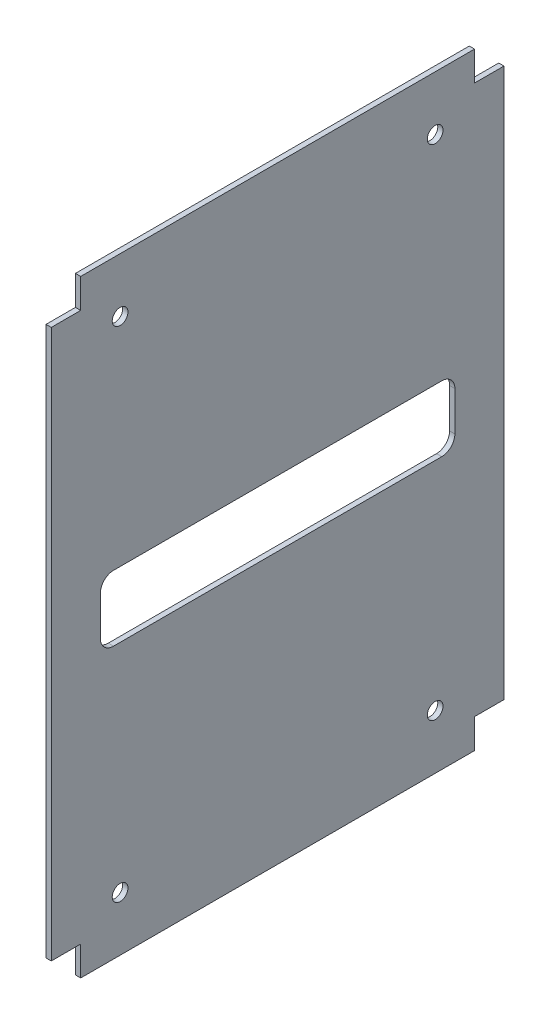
ISO-10303-21;
HEADER;
FILE_DESCRIPTION(('STEP AP214'),'2;1');
FILE_NAME('part.step','',(''),(''),'','','');
FILE_SCHEMA(('AUTOMOTIVE_DESIGN { 1 0 10303 214 1 1 1 1 }'));
ENDSEC;
DATA;
#1=APPLICATION_CONTEXT('core data for automotive mechanical design processes');
#2=APPLICATION_PROTOCOL_DEFINITION('international standard','automotive_design',2000,#1);
#3=PRODUCT_CONTEXT('',#1,'mechanical');
#4=PRODUCT('Part','Part','',(#3));
#5=PRODUCT_RELATED_PRODUCT_CATEGORY('part','',(#4));
#6=PRODUCT_DEFINITION_FORMATION('','',#4);
#7=PRODUCT_DEFINITION_CONTEXT('part definition',#1,'design');
#8=PRODUCT_DEFINITION('design','',#6,#7);
#9=PRODUCT_DEFINITION_SHAPE('','',#8);
#10=(LENGTH_UNIT() NAMED_UNIT(*) SI_UNIT(.MILLI.,.METRE.));
#11=(NAMED_UNIT(*) PLANE_ANGLE_UNIT() SI_UNIT($,.RADIAN.));
#12=(NAMED_UNIT(*) SI_UNIT($,.STERADIAN.) SOLID_ANGLE_UNIT());
#13=UNCERTAINTY_MEASURE_WITH_UNIT(LENGTH_MEASURE(1.E-05),#10,'distance_accuracy_value','');
#14=(GEOMETRIC_REPRESENTATION_CONTEXT(3) GLOBAL_UNCERTAINTY_ASSIGNED_CONTEXT((#13)) GLOBAL_UNIT_ASSIGNED_CONTEXT((#10,
#11,#12)) REPRESENTATION_CONTEXT('',''));
#15=CARTESIAN_POINT('',(0.,0.,0.));
#16=DIRECTION('',(0.,0.,1.));
#17=DIRECTION('',(1.,0.,0.));
#18=AXIS2_PLACEMENT_3D('',#15,#16,#17);
#19=CARTESIAN_POINT('',(-1.99999999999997,108.5,75.));
#20=DIRECTION('',(1.,0.,0.));
#21=DIRECTION('',(0.,0.,-1.));
#22=AXIS2_PLACEMENT_3D('',#19,#20,#21);
#23=PLANE('',#22);
#24=DIRECTION('',(0.,0.,-1.));
#25=VECTOR('',#24,1.);
#26=CARTESIAN_POINT('',(-1.99999999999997,-12.5,75.));
#27=LINE('',#26,#25);
#28=CARTESIAN_POINT('',(-1.99999999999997,-12.5,62.5));
#29=VERTEX_POINT('',#28);
#30=CARTESIAN_POINT('',(-1.99999999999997,-12.5,-62.5));
#31=VERTEX_POINT('',#30);
#32=EDGE_CURVE('E460',#29,#31,#27,.T.);
#33=ORIENTED_EDGE('',*,*,#32,.T.);
#34=CARTESIAN_POINT('',(-1.99999999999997,-7.5,-62.5));
#35=DIRECTION('',(1.,0.,0.));
#36=DIRECTION('',(0.,0.,-1.));
#37=AXIS2_PLACEMENT_3D('',#34,#35,#36);
#38=CIRCLE('',#37,5.00000000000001);
#39=CARTESIAN_POINT('',(-1.99999999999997,-7.5,-67.5));
#40=VERTEX_POINT('',#39);
#41=EDGE_CURVE('E463',#31,#40,#38,.T.);
#42=ORIENTED_EDGE('',*,*,#41,.T.);
#43=DIRECTION('',(0.,1.,0.));
#44=VECTOR('',#43,1.);
#45=CARTESIAN_POINT('',(-1.99999999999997,108.5,-67.5));
#46=LINE('',#45,#44);
#47=CARTESIAN_POINT('',(-1.99999999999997,7.49999999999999,-67.5));
#48=VERTEX_POINT('',#47);
#49=EDGE_CURVE('E428',#40,#48,#46,.T.);
#50=ORIENTED_EDGE('',*,*,#49,.T.);
#51=CARTESIAN_POINT('',(-1.99999999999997,7.5,-62.5));
#52=DIRECTION('',(1.,0.,0.));
#53=DIRECTION('',(0.,0.,-1.));
#54=AXIS2_PLACEMENT_3D('',#51,#52,#53);
#55=CIRCLE('',#54,5.00000000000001);
#56=CARTESIAN_POINT('',(-1.99999999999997,12.5,-62.5));
#57=VERTEX_POINT('',#56);
#58=EDGE_CURVE('E445',#48,#57,#55,.T.);
#59=ORIENTED_EDGE('',*,*,#58,.T.);
#60=DIRECTION('',(0.,0.,1.));
#61=VECTOR('',#60,1.);
#62=CARTESIAN_POINT('',(-1.99999999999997,12.5,75.));
#63=LINE('',#62,#61);
#64=CARTESIAN_POINT('',(-1.99999999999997,12.5,62.5));
#65=VERTEX_POINT('',#64);
#66=EDGE_CURVE('E448',#57,#65,#63,.T.);
#67=ORIENTED_EDGE('',*,*,#66,.T.);
#68=CARTESIAN_POINT('',(-1.99999999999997,7.5,62.5));
#69=DIRECTION('',(1.,0.,0.));
#70=DIRECTION('',(0.,0.,-1.));
#71=AXIS2_PLACEMENT_3D('',#68,#69,#70);
#72=CIRCLE('',#71,5.);
#73=CARTESIAN_POINT('',(-1.99999999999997,7.5,67.5));
#74=VERTEX_POINT('',#73);
#75=EDGE_CURVE('E451',#65,#74,#72,.T.);
#76=ORIENTED_EDGE('',*,*,#75,.T.);
#77=DIRECTION('',(0.,-1.,0.));
#78=VECTOR('',#77,1.);
#79=CARTESIAN_POINT('',(-1.99999999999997,108.5,67.5));
#80=LINE('',#79,#78);
#81=CARTESIAN_POINT('',(-1.99999999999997,-7.5,67.5));
#82=VERTEX_POINT('',#81);
#83=EDGE_CURVE('E454',#74,#82,#80,.T.);
#84=ORIENTED_EDGE('',*,*,#83,.T.);
#85=CARTESIAN_POINT('',(-1.99999999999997,-7.5,62.5));
#86=DIRECTION('',(1.,0.,0.));
#87=DIRECTION('',(0.,0.,-1.));
#88=AXIS2_PLACEMENT_3D('',#85,#86,#87);
#89=CIRCLE('',#88,5.);
#90=EDGE_CURVE('E457',#82,#29,#89,.T.);
#91=ORIENTED_EDGE('',*,*,#90,.T.);
#92=EDGE_LOOP('',(#33,#42,#50,#59,#67,#76,#84,#91));
#93=FACE_BOUND('',#92,.T.);
#94=CARTESIAN_POINT('',(-1.99999999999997,95.0000000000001,60.0000000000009));
#95=DIRECTION('',(1.,0.,0.));
#96=DIRECTION('',(0.,0.,-1.));
#97=AXIS2_PLACEMENT_3D('',#94,#95,#96);
#98=CIRCLE('',#97,3.);
#99=CARTESIAN_POINT('',(-1.99999999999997,95.0000000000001,57.0000000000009));
#100=VERTEX_POINT('',#99);
#101=EDGE_CURVE('E469',#100,#100,#98,.T.);
#102=ORIENTED_EDGE('',*,*,#101,.T.);
#103=EDGE_LOOP('',(#102));
#104=FACE_BOUND('',#103,.T.);
#105=CARTESIAN_POINT('',(-1.99999999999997,95.0000000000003,-59.9999999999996));
#106=DIRECTION('',(1.,0.,0.));
#107=DIRECTION('',(0.,0.,-1.));
#108=AXIS2_PLACEMENT_3D('',#105,#106,#107);
#109=CIRCLE('',#108,3.);
#110=CARTESIAN_POINT('',(-1.99999999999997,95.0000000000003,-62.9999999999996));
#111=VERTEX_POINT('',#110);
#112=EDGE_CURVE('E475',#111,#111,#109,.T.);
#113=ORIENTED_EDGE('',*,*,#112,.T.);
#114=EDGE_LOOP('',(#113));
#115=FACE_BOUND('',#114,.T.);
#116=CARTESIAN_POINT('',(-1.99999999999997,-94.9999999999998,-60.));
#117=DIRECTION('',(1.,0.,0.));
#118=DIRECTION('',(0.,0.,-1.));
#119=AXIS2_PLACEMENT_3D('',#116,#117,#118);
#120=CIRCLE('',#119,3.);
#121=CARTESIAN_POINT('',(-1.99999999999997,-94.9999999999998,-63.));
#122=VERTEX_POINT('',#121);
#123=EDGE_CURVE('E481',#122,#122,#120,.T.);
#124=ORIENTED_EDGE('',*,*,#123,.T.);
#125=EDGE_LOOP('',(#124));
#126=FACE_BOUND('',#125,.T.);
#127=CARTESIAN_POINT('',(-1.99999999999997,-94.9999999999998,60.0000000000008));
#128=DIRECTION('',(1.,0.,0.));
#129=DIRECTION('',(0.,0.,-1.));
#130=AXIS2_PLACEMENT_3D('',#127,#128,#129);
#131=CIRCLE('',#130,3.);
#132=CARTESIAN_POINT('',(-1.99999999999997,-94.9999999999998,57.0000000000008));
#133=VERTEX_POINT('',#132);
#134=EDGE_CURVE('E487',#133,#133,#131,.T.);
#135=ORIENTED_EDGE('',*,*,#134,.T.);
#136=EDGE_LOOP('',(#135));
#137=FACE_BOUND('',#136,.T.);
#138=DIRECTION('',(0.,1.,0.));
#139=VECTOR('',#138,1.);
#140=CARTESIAN_POINT('',(-1.99999999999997,106.856194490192,-75.));
#141=LINE('',#140,#139);
#142=CARTESIAN_POINT('',(-1.99999999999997,104.5,-75.));
#143=VERTEX_POINT('',#142);
#144=CARTESIAN_POINT('',(-1.99999999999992,115.712388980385,-75.));
#145=VERTEX_POINT('',#144);
#146=EDGE_CURVE('E332',#143,#145,#141,.T.);
#147=ORIENTED_EDGE('',*,*,#146,.F.);
#148=DIRECTION('',(0.,0.,-1.));
#149=VECTOR('',#148,1.);
#150=CARTESIAN_POINT('',(-1.99999999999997,104.5,-77.3561944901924));
#151=LINE('',#150,#149);
#152=CARTESIAN_POINT('',(-1.9999999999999,104.5,-86.2123889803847));
#153=VERTEX_POINT('',#152);
#154=EDGE_CURVE('E199',#153,#143,#151,.F.);
#155=ORIENTED_EDGE('',*,*,#154,.F.);
#156=DIRECTION('',(0.,1.,0.));
#157=VECTOR('',#156,1.);
#158=CARTESIAN_POINT('',(-1.9999999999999,0.,-86.2123889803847));
#159=LINE('',#158,#157);
#160=CARTESIAN_POINT('',(-1.9999999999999,-104.5,-86.2123889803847));
#161=VERTEX_POINT('',#160);
#162=EDGE_CURVE('E388',#153,#161,#159,.F.);
#163=ORIENTED_EDGE('',*,*,#162,.T.);
#164=DIRECTION('',(0.,0.,-1.));
#165=VECTOR('',#164,1.);
#166=CARTESIAN_POINT('',(-1.99999999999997,-104.5,-77.3561944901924));
#167=LINE('',#166,#165);
#168=CARTESIAN_POINT('',(-1.99999999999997,-104.5,-75.));
#169=VERTEX_POINT('',#168);
#170=EDGE_CURVE('E387',#169,#161,#167,.T.);
#171=ORIENTED_EDGE('',*,*,#170,.F.);
#172=DIRECTION('',(0.,1.,0.));
#173=VECTOR('',#172,1.);
#174=CARTESIAN_POINT('',(-1.99999999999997,-106.856194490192,-75.));
#175=LINE('',#174,#173);
#176=CARTESIAN_POINT('',(-1.99999999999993,-115.712388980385,-75.));
#177=VERTEX_POINT('',#176);
#178=EDGE_CURVE('E360',#177,#169,#175,.T.);
#179=ORIENTED_EDGE('',*,*,#178,.F.);
#180=DIRECTION('',(0.,0.,-1.));
#181=VECTOR('',#180,1.);
#182=CARTESIAN_POINT('',(-1.99999999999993,-115.712388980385,0.));
#183=LINE('',#182,#181);
#184=CARTESIAN_POINT('',(-1.99999999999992,-115.712388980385,75.));
#185=VERTEX_POINT('',#184);
#186=EDGE_CURVE('E349',#177,#185,#183,.F.);
#187=ORIENTED_EDGE('',*,*,#186,.T.);
#188=DIRECTION('',(0.,1.,0.));
#189=VECTOR('',#188,1.);
#190=CARTESIAN_POINT('',(-1.99999999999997,-106.856194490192,75.));
#191=LINE('',#190,#189);
#192=CARTESIAN_POINT('',(-1.99999999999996,-104.5,75.));
#193=VERTEX_POINT('',#192);
#194=EDGE_CURVE('E348',#193,#185,#191,.F.);
#195=ORIENTED_EDGE('',*,*,#194,.F.);
#196=DIRECTION('',(0.,0.,-1.));
#197=VECTOR('',#196,1.);
#198=CARTESIAN_POINT('',(-1.99999999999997,-104.5,77.3561944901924));
#199=LINE('',#198,#197);
#200=CARTESIAN_POINT('',(-1.9999999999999,-104.5,86.2123889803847));
#201=VERTEX_POINT('',#200);
#202=EDGE_CURVE('E380',#201,#193,#199,.T.);
#203=ORIENTED_EDGE('',*,*,#202,.F.);
#204=DIRECTION('',(0.,-1.,0.));
#205=VECTOR('',#204,1.);
#206=CARTESIAN_POINT('',(-1.9999999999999,0.,86.2123889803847));
#207=LINE('',#206,#205);
#208=CARTESIAN_POINT('',(-1.9999999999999,104.5,86.2123889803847));
#209=VERTEX_POINT('',#208);
#210=EDGE_CURVE('E370',#201,#209,#207,.F.);
#211=ORIENTED_EDGE('',*,*,#210,.T.);
#212=DIRECTION('',(0.,0.,-1.));
#213=VECTOR('',#212,1.);
#214=CARTESIAN_POINT('',(-1.99999999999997,104.5,77.3561944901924));
#215=LINE('',#214,#213);
#216=CARTESIAN_POINT('',(-1.99999999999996,104.5,75.));
#217=VERTEX_POINT('',#216);
#218=EDGE_CURVE('E191',#217,#209,#215,.F.);
#219=ORIENTED_EDGE('',*,*,#218,.F.);
#220=DIRECTION('',(0.,1.,0.));
#221=VECTOR('',#220,1.);
#222=CARTESIAN_POINT('',(-1.99999999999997,106.856194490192,75.));
#223=LINE('',#222,#221);
#224=CARTESIAN_POINT('',(-1.99999999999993,115.712388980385,75.));
#225=VERTEX_POINT('',#224);
#226=EDGE_CURVE('E341',#225,#217,#223,.F.);
#227=ORIENTED_EDGE('',*,*,#226,.F.);
#228=DIRECTION('',(0.,0.,1.));
#229=VECTOR('',#228,1.);
#230=CARTESIAN_POINT('',(-1.99999999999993,115.712388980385,0.));
#231=LINE('',#230,#229);
#232=EDGE_CURVE('E331',#225,#145,#231,.F.);
#233=ORIENTED_EDGE('',*,*,#232,.T.);
#234=EDGE_LOOP('',(#147,#155,#163,#171,#179,#187,#195,#203,#211,#219,#227,#233));
#235=FACE_BOUND('',#234,.T.);
#236=ADVANCED_FACE('F176',(#93,#104,#115,#126,#137,#235),#23,.F.);
#237=CARTESIAN_POINT('',(0.,108.5,75.));
#238=DIRECTION('',(1.,0.,0.));
#239=DIRECTION('',(0.,0.,-1.));
#240=AXIS2_PLACEMENT_3D('',#237,#238,#239);
#241=PLANE('',#240);
#242=CARTESIAN_POINT('',(0.,-7.5,-62.5));
#243=DIRECTION('',(1.,0.,0.));
#244=DIRECTION('',(0.,0.,1.));
#245=AXIS2_PLACEMENT_3D('',#242,#243,#244);
#246=CIRCLE('',#245,5.00000000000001);
#247=CARTESIAN_POINT('',(0.,-12.5,-62.5));
#248=VERTEX_POINT('',#247);
#249=CARTESIAN_POINT('',(0.,-7.49999999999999,-67.5));
#250=VERTEX_POINT('',#249);
#251=EDGE_CURVE('E400',#248,#250,#246,.T.);
#252=ORIENTED_EDGE('',*,*,#251,.F.);
#253=DIRECTION('',(0.,0.,-1.));
#254=VECTOR('',#253,1.);
#255=CARTESIAN_POINT('',(0.,-12.5,62.5));
#256=LINE('',#255,#254);
#257=CARTESIAN_POINT('',(0.,-12.5,62.5));
#258=VERTEX_POINT('',#257);
#259=EDGE_CURVE('E422',#258,#248,#256,.T.);
#260=ORIENTED_EDGE('',*,*,#259,.F.);
#261=CARTESIAN_POINT('',(0.,-7.5,62.5));
#262=DIRECTION('',(1.,0.,0.));
#263=DIRECTION('',(0.,0.,1.));
#264=AXIS2_PLACEMENT_3D('',#261,#262,#263);
#265=CIRCLE('',#264,5.);
#266=CARTESIAN_POINT('',(0.,-7.5,67.5));
#267=VERTEX_POINT('',#266);
#268=EDGE_CURVE('E419',#267,#258,#265,.T.);
#269=ORIENTED_EDGE('',*,*,#268,.F.);
#270=DIRECTION('',(0.,-1.,0.));
#271=VECTOR('',#270,1.);
#272=CARTESIAN_POINT('',(0.,-7.5,67.5));
#273=LINE('',#272,#271);
#274=CARTESIAN_POINT('',(0.,7.5,67.5));
#275=VERTEX_POINT('',#274);
#276=EDGE_CURVE('E416',#275,#267,#273,.T.);
#277=ORIENTED_EDGE('',*,*,#276,.F.);
#278=CARTESIAN_POINT('',(0.,7.5,62.5));
#279=DIRECTION('',(1.,0.,0.));
#280=DIRECTION('',(0.,0.,1.));
#281=AXIS2_PLACEMENT_3D('',#278,#279,#280);
#282=CIRCLE('',#281,5.);
#283=CARTESIAN_POINT('',(0.,12.5,62.5));
#284=VERTEX_POINT('',#283);
#285=EDGE_CURVE('E413',#284,#275,#282,.T.);
#286=ORIENTED_EDGE('',*,*,#285,.F.);
#287=DIRECTION('',(0.,0.,1.));
#288=VECTOR('',#287,1.);
#289=CARTESIAN_POINT('',(0.,12.5,62.5));
#290=LINE('',#289,#288);
#291=CARTESIAN_POINT('',(0.,12.5,-62.5));
#292=VERTEX_POINT('',#291);
#293=EDGE_CURVE('E410',#292,#284,#290,.T.);
#294=ORIENTED_EDGE('',*,*,#293,.F.);
#295=CARTESIAN_POINT('',(0.,7.5,-62.5));
#296=DIRECTION('',(1.,0.,0.));
#297=DIRECTION('',(0.,0.,1.));
#298=AXIS2_PLACEMENT_3D('',#295,#296,#297);
#299=CIRCLE('',#298,5.00000000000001);
#300=CARTESIAN_POINT('',(0.,7.5,-67.5));
#301=VERTEX_POINT('',#300);
#302=EDGE_CURVE('E407',#301,#292,#299,.T.);
#303=ORIENTED_EDGE('',*,*,#302,.F.);
#304=DIRECTION('',(0.,1.,0.));
#305=VECTOR('',#304,1.);
#306=CARTESIAN_POINT('',(0.,-7.5,-67.5));
#307=LINE('',#306,#305);
#308=EDGE_CURVE('E404',#250,#301,#307,.T.);
#309=ORIENTED_EDGE('',*,*,#308,.F.);
#310=EDGE_LOOP('',(#252,#260,#269,#277,#286,#294,#303,#309));
#311=FACE_BOUND('',#310,.T.);
#312=CARTESIAN_POINT('',(0.,95.0000000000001,60.0000000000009));
#313=DIRECTION('',(1.,0.,0.));
#314=DIRECTION('',(0.,0.,-1.));
#315=AXIS2_PLACEMENT_3D('',#312,#313,#314);
#316=CIRCLE('',#315,3.);
#317=CARTESIAN_POINT('',(0.,95.0000000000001,57.0000000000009));
#318=VERTEX_POINT('',#317);
#319=EDGE_CURVE('E466',#318,#318,#316,.T.);
#320=ORIENTED_EDGE('',*,*,#319,.F.);
#321=EDGE_LOOP('',(#320));
#322=FACE_BOUND('',#321,.T.);
#323=CARTESIAN_POINT('',(0.,95.0000000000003,-59.9999999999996));
#324=DIRECTION('',(1.,0.,0.));
#325=DIRECTION('',(0.,0.,-1.));
#326=AXIS2_PLACEMENT_3D('',#323,#324,#325);
#327=CIRCLE('',#326,3.);
#328=CARTESIAN_POINT('',(0.,95.0000000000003,-62.9999999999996));
#329=VERTEX_POINT('',#328);
#330=EDGE_CURVE('E472',#329,#329,#327,.T.);
#331=ORIENTED_EDGE('',*,*,#330,.F.);
#332=EDGE_LOOP('',(#331));
#333=FACE_BOUND('',#332,.T.);
#334=CARTESIAN_POINT('',(0.,-94.9999999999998,-60.));
#335=DIRECTION('',(1.,0.,0.));
#336=DIRECTION('',(0.,0.,-1.));
#337=AXIS2_PLACEMENT_3D('',#334,#335,#336);
#338=CIRCLE('',#337,3.);
#339=CARTESIAN_POINT('',(0.,-94.9999999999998,-63.));
#340=VERTEX_POINT('',#339);
#341=EDGE_CURVE('E478',#340,#340,#338,.T.);
#342=ORIENTED_EDGE('',*,*,#341,.F.);
#343=EDGE_LOOP('',(#342));
#344=FACE_BOUND('',#343,.T.);
#345=CARTESIAN_POINT('',(0.,-94.9999999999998,60.0000000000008));
#346=DIRECTION('',(1.,0.,0.));
#347=DIRECTION('',(0.,0.,-1.));
#348=AXIS2_PLACEMENT_3D('',#345,#346,#347);
#349=CIRCLE('',#348,3.);
#350=CARTESIAN_POINT('',(0.,-94.9999999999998,57.0000000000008));
#351=VERTEX_POINT('',#350);
#352=EDGE_CURVE('E484',#351,#351,#349,.T.);
#353=ORIENTED_EDGE('',*,*,#352,.F.);
#354=EDGE_LOOP('',(#353));
#355=FACE_BOUND('',#354,.T.);
#356=DIRECTION('',(0.,1.,0.));
#357=VECTOR('',#356,1.);
#358=CARTESIAN_POINT('',(0.,106.856194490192,75.));
#359=LINE('',#358,#357);
#360=CARTESIAN_POINT('',(0.,115.712388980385,75.));
#361=VERTEX_POINT('',#360);
#362=CARTESIAN_POINT('',(0.,104.5,75.));
#363=VERTEX_POINT('',#362);
#364=EDGE_CURVE('E314',#361,#363,#359,.F.);
#365=ORIENTED_EDGE('',*,*,#364,.T.);
#366=DIRECTION('',(0.,0.,-1.));
#367=VECTOR('',#366,1.);
#368=CARTESIAN_POINT('',(0.,104.5,77.3561944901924));
#369=LINE('',#368,#367);
#370=CARTESIAN_POINT('',(0.,104.5,86.2123889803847));
#371=VERTEX_POINT('',#370);
#372=EDGE_CURVE('E377',#363,#371,#369,.F.);
#373=ORIENTED_EDGE('',*,*,#372,.T.);
#374=DIRECTION('',(0.,1.,0.));
#375=VECTOR('',#374,1.);
#376=CARTESIAN_POINT('',(0.,104.5,86.2123889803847));
#377=LINE('',#376,#375);
#378=CARTESIAN_POINT('',(0.,-104.5,86.2123889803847));
#379=VERTEX_POINT('',#378);
#380=EDGE_CURVE('E363',#379,#371,#377,.T.);
#381=ORIENTED_EDGE('',*,*,#380,.F.);
#382=DIRECTION('',(0.,0.,-1.));
#383=VECTOR('',#382,1.);
#384=CARTESIAN_POINT('',(0.,-104.5,77.3561944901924));
#385=LINE('',#384,#383);
#386=CARTESIAN_POINT('',(0.,-104.5,75.));
#387=VERTEX_POINT('',#386);
#388=EDGE_CURVE('E379',#379,#387,#385,.T.);
#389=ORIENTED_EDGE('',*,*,#388,.T.);
#390=DIRECTION('',(0.,1.,0.));
#391=VECTOR('',#390,1.);
#392=CARTESIAN_POINT('',(0.,-106.856194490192,75.));
#393=LINE('',#392,#391);
#394=CARTESIAN_POINT('',(0.,-115.712388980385,75.));
#395=VERTEX_POINT('',#394);
#396=EDGE_CURVE('E357',#387,#395,#393,.F.);
#397=ORIENTED_EDGE('',*,*,#396,.T.);
#398=DIRECTION('',(0.,0.,1.));
#399=VECTOR('',#398,1.);
#400=CARTESIAN_POINT('',(0.,-115.712388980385,75.));
#401=LINE('',#400,#399);
#402=CARTESIAN_POINT('',(0.,-115.712388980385,-75.));
#403=VERTEX_POINT('',#402);
#404=EDGE_CURVE('E322',#403,#395,#401,.T.);
#405=ORIENTED_EDGE('',*,*,#404,.F.);
#406=DIRECTION('',(0.,1.,0.));
#407=VECTOR('',#406,1.);
#408=CARTESIAN_POINT('',(0.,-106.856194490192,-75.));
#409=LINE('',#408,#407);
#410=CARTESIAN_POINT('',(0.,-104.5,-75.));
#411=VERTEX_POINT('',#410);
#412=EDGE_CURVE('E359',#403,#411,#409,.T.);
#413=ORIENTED_EDGE('',*,*,#412,.T.);
#414=DIRECTION('',(0.,0.,-1.));
#415=VECTOR('',#414,1.);
#416=CARTESIAN_POINT('',(0.,-104.5,-77.3561944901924));
#417=LINE('',#416,#415);
#418=CARTESIAN_POINT('',(0.,-104.5,-86.2123889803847));
#419=VERTEX_POINT('',#418);
#420=EDGE_CURVE('E396',#411,#419,#417,.T.);
#421=ORIENTED_EDGE('',*,*,#420,.T.);
#422=DIRECTION('',(0.,-1.,0.));
#423=VECTOR('',#422,1.);
#424=CARTESIAN_POINT('',(0.,-104.5,-86.2123889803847));
#425=LINE('',#424,#423);
#426=CARTESIAN_POINT('',(0.,104.5,-86.2123889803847));
#427=VERTEX_POINT('',#426);
#428=EDGE_CURVE('E382',#427,#419,#425,.T.);
#429=ORIENTED_EDGE('',*,*,#428,.F.);
#430=DIRECTION('',(0.,0.,-1.));
#431=VECTOR('',#430,1.);
#432=CARTESIAN_POINT('',(0.,104.5,-77.3561944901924));
#433=LINE('',#432,#431);
#434=CARTESIAN_POINT('',(0.,104.5,-75.));
#435=VERTEX_POINT('',#434);
#436=EDGE_CURVE('E398',#427,#435,#433,.F.);
#437=ORIENTED_EDGE('',*,*,#436,.T.);
#438=DIRECTION('',(0.,1.,0.));
#439=VECTOR('',#438,1.);
#440=CARTESIAN_POINT('',(0.,106.856194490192,-75.));
#441=LINE('',#440,#439);
#442=CARTESIAN_POINT('',(0.,115.712388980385,-75.));
#443=VERTEX_POINT('',#442);
#444=EDGE_CURVE('E323',#435,#443,#441,.T.);
#445=ORIENTED_EDGE('',*,*,#444,.T.);
#446=DIRECTION('',(0.,0.,-1.));
#447=VECTOR('',#446,1.);
#448=CARTESIAN_POINT('',(0.,115.712388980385,-75.));
#449=LINE('',#448,#447);
#450=EDGE_CURVE('E329',#361,#443,#449,.T.);
#451=ORIENTED_EDGE('',*,*,#450,.F.);
#452=EDGE_LOOP('',(#365,#373,#381,#389,#397,#405,#413,#421,#429,#437,#445,#451));
#453=FACE_BOUND('',#452,.T.);
#454=ADVANCED_FACE('F178',(#311,#322,#333,#344,#355,#453),#241,.T.);
#455=CARTESIAN_POINT('',(0.,-94.9999999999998,60.0000000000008));
#456=DIRECTION('',(1.,0.,0.));
#457=DIRECTION('',(0.,0.,-1.));
#458=AXIS2_PLACEMENT_3D('',#455,#456,#457);
#459=CYLINDRICAL_SURFACE('',#458,3.);
#460=ORIENTED_EDGE('',*,*,#352,.T.);
#461=EDGE_LOOP('',(#460));
#462=FACE_BOUND('',#461,.T.);
#463=ORIENTED_EDGE('',*,*,#134,.F.);
#464=EDGE_LOOP('',(#463));
#465=FACE_BOUND('',#464,.T.);
#466=ADVANCED_FACE('F545',(#462,#465),#459,.F.);
#467=CARTESIAN_POINT('',(0.,-94.9999999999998,-60.));
#468=DIRECTION('',(1.,0.,0.));
#469=DIRECTION('',(0.,0.,-1.));
#470=AXIS2_PLACEMENT_3D('',#467,#468,#469);
#471=CYLINDRICAL_SURFACE('',#470,3.);
#472=ORIENTED_EDGE('',*,*,#341,.T.);
#473=EDGE_LOOP('',(#472));
#474=FACE_BOUND('',#473,.T.);
#475=ORIENTED_EDGE('',*,*,#123,.F.);
#476=EDGE_LOOP('',(#475));
#477=FACE_BOUND('',#476,.T.);
#478=ADVANCED_FACE('F551',(#474,#477),#471,.F.);
#479=CARTESIAN_POINT('',(0.,95.0000000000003,-59.9999999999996));
#480=DIRECTION('',(1.,0.,0.));
#481=DIRECTION('',(0.,0.,-1.));
#482=AXIS2_PLACEMENT_3D('',#479,#480,#481);
#483=CYLINDRICAL_SURFACE('',#482,3.);
#484=ORIENTED_EDGE('',*,*,#330,.T.);
#485=EDGE_LOOP('',(#484));
#486=FACE_BOUND('',#485,.T.);
#487=ORIENTED_EDGE('',*,*,#112,.F.);
#488=EDGE_LOOP('',(#487));
#489=FACE_BOUND('',#488,.T.);
#490=ADVANCED_FACE('F555',(#486,#489),#483,.F.);
#491=CARTESIAN_POINT('',(0.,95.0000000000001,60.0000000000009));
#492=DIRECTION('',(1.,0.,0.));
#493=DIRECTION('',(0.,0.,-1.));
#494=AXIS2_PLACEMENT_3D('',#491,#492,#493);
#495=CYLINDRICAL_SURFACE('',#494,3.);
#496=ORIENTED_EDGE('',*,*,#319,.T.);
#497=EDGE_LOOP('',(#496));
#498=FACE_BOUND('',#497,.T.);
#499=ORIENTED_EDGE('',*,*,#101,.F.);
#500=EDGE_LOOP('',(#499));
#501=FACE_BOUND('',#500,.T.);
#502=ADVANCED_FACE('F559',(#498,#501),#495,.F.);
#503=CARTESIAN_POINT('',(-10.,-7.5,-62.5));
#504=DIRECTION('',(1.,0.,0.));
#505=DIRECTION('',(0.,0.,-1.));
#506=AXIS2_PLACEMENT_3D('',#503,#504,#505);
#507=CYLINDRICAL_SURFACE('',#506,5.00000000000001);
#508=DIRECTION('',(1.,0.,0.));
#509=VECTOR('',#508,1.);
#510=CARTESIAN_POINT('',(-10.,-12.5,-62.5));
#511=LINE('',#510,#509);
#512=EDGE_CURVE('E426',#31,#248,#511,.T.);
#513=ORIENTED_EDGE('',*,*,#512,.T.);
#514=ORIENTED_EDGE('',*,*,#251,.T.);
#515=DIRECTION('',(1.,0.,0.));
#516=VECTOR('',#515,1.);
#517=CARTESIAN_POINT('',(-10.,-7.5,-67.5));
#518=LINE('',#517,#516);
#519=EDGE_CURVE('E425',#40,#250,#518,.T.);
#520=ORIENTED_EDGE('',*,*,#519,.F.);
#521=ORIENTED_EDGE('',*,*,#41,.F.);
#522=EDGE_LOOP('',(#513,#514,#520,#521));
#523=FACE_BOUND('',#522,.T.);
#524=ADVANCED_FACE('F563',(#523),#507,.F.);
#525=CARTESIAN_POINT('',(-10.,-12.5,62.5));
#526=DIRECTION('',(0.,-1.,0.));
#527=DIRECTION('',(0.,0.,-1.));
#528=AXIS2_PLACEMENT_3D('',#525,#526,#527);
#529=PLANE('',#528);
#530=DIRECTION('',(1.,0.,0.));
#531=VECTOR('',#530,1.);
#532=CARTESIAN_POINT('',(-10.,-12.5,62.5));
#533=LINE('',#532,#531);
#534=EDGE_CURVE('E429',#29,#258,#533,.T.);
#535=ORIENTED_EDGE('',*,*,#534,.T.);
#536=ORIENTED_EDGE('',*,*,#259,.T.);
#537=ORIENTED_EDGE('',*,*,#512,.F.);
#538=ORIENTED_EDGE('',*,*,#32,.F.);
#539=EDGE_LOOP('',(#535,#536,#537,#538));
#540=FACE_BOUND('',#539,.T.);
#541=ADVANCED_FACE('F567',(#540),#529,.F.);
#542=CARTESIAN_POINT('',(-10.,-7.5,62.5));
#543=DIRECTION('',(1.,0.,0.));
#544=DIRECTION('',(0.,0.,-1.));
#545=AXIS2_PLACEMENT_3D('',#542,#543,#544);
#546=CYLINDRICAL_SURFACE('',#545,5.);
#547=DIRECTION('',(1.,0.,0.));
#548=VECTOR('',#547,1.);
#549=CARTESIAN_POINT('',(-10.,-7.5,67.5));
#550=LINE('',#549,#548);
#551=EDGE_CURVE('E431',#82,#267,#550,.T.);
#552=ORIENTED_EDGE('',*,*,#551,.T.);
#553=ORIENTED_EDGE('',*,*,#268,.T.);
#554=ORIENTED_EDGE('',*,*,#534,.F.);
#555=ORIENTED_EDGE('',*,*,#90,.F.);
#556=EDGE_LOOP('',(#552,#553,#554,#555));
#557=FACE_BOUND('',#556,.T.);
#558=ADVANCED_FACE('F588',(#557),#546,.F.);
#559=CARTESIAN_POINT('',(-10.,-7.5,67.5));
#560=DIRECTION('',(0.,0.,1.));
#561=DIRECTION('',(1.,0.,0.));
#562=AXIS2_PLACEMENT_3D('',#559,#560,#561);
#563=PLANE('',#562);
#564=DIRECTION('',(1.,0.,0.));
#565=VECTOR('',#564,1.);
#566=CARTESIAN_POINT('',(-10.,7.5,67.5));
#567=LINE('',#566,#565);
#568=EDGE_CURVE('E433',#74,#275,#567,.T.);
#569=ORIENTED_EDGE('',*,*,#568,.T.);
#570=ORIENTED_EDGE('',*,*,#276,.T.);
#571=ORIENTED_EDGE('',*,*,#551,.F.);
#572=ORIENTED_EDGE('',*,*,#83,.F.);
#573=EDGE_LOOP('',(#569,#570,#571,#572));
#574=FACE_BOUND('',#573,.T.);
#575=ADVANCED_FACE('F584',(#574),#563,.F.);
#576=CARTESIAN_POINT('',(-10.,7.5,62.5));
#577=DIRECTION('',(1.,0.,0.));
#578=DIRECTION('',(0.,0.,-1.));
#579=AXIS2_PLACEMENT_3D('',#576,#577,#578);
#580=CYLINDRICAL_SURFACE('',#579,5.);
#581=DIRECTION('',(1.,0.,0.));
#582=VECTOR('',#581,1.);
#583=CARTESIAN_POINT('',(-10.,12.5,62.5));
#584=LINE('',#583,#582);
#585=EDGE_CURVE('E435',#65,#284,#584,.T.);
#586=ORIENTED_EDGE('',*,*,#585,.T.);
#587=ORIENTED_EDGE('',*,*,#285,.T.);
#588=ORIENTED_EDGE('',*,*,#568,.F.);
#589=ORIENTED_EDGE('',*,*,#75,.F.);
#590=EDGE_LOOP('',(#586,#587,#588,#589));
#591=FACE_BOUND('',#590,.T.);
#592=ADVANCED_FACE('F580',(#591),#580,.F.);
#593=CARTESIAN_POINT('',(-10.,12.5,62.5));
#594=DIRECTION('',(0.,1.,0.));
#595=DIRECTION('',(0.,0.,1.));
#596=AXIS2_PLACEMENT_3D('',#593,#594,#595);
#597=PLANE('',#596);
#598=DIRECTION('',(1.,0.,0.));
#599=VECTOR('',#598,1.);
#600=CARTESIAN_POINT('',(-10.,12.5,-62.5));
#601=LINE('',#600,#599);
#602=EDGE_CURVE('E437',#57,#292,#601,.T.);
#603=ORIENTED_EDGE('',*,*,#602,.T.);
#604=ORIENTED_EDGE('',*,*,#293,.T.);
#605=ORIENTED_EDGE('',*,*,#585,.F.);
#606=ORIENTED_EDGE('',*,*,#66,.F.);
#607=EDGE_LOOP('',(#603,#604,#605,#606));
#608=FACE_BOUND('',#607,.T.);
#609=ADVANCED_FACE('F576',(#608),#597,.F.);
#610=CARTESIAN_POINT('',(-10.,7.5,-62.5));
#611=DIRECTION('',(1.,0.,0.));
#612=DIRECTION('',(0.,0.,-1.));
#613=AXIS2_PLACEMENT_3D('',#610,#611,#612);
#614=CYLINDRICAL_SURFACE('',#613,5.00000000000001);
#615=DIRECTION('',(1.,0.,0.));
#616=VECTOR('',#615,1.);
#617=CARTESIAN_POINT('',(-10.,7.5,-67.5));
#618=LINE('',#617,#616);
#619=EDGE_CURVE('E439',#48,#301,#618,.T.);
#620=ORIENTED_EDGE('',*,*,#619,.T.);
#621=ORIENTED_EDGE('',*,*,#302,.T.);
#622=ORIENTED_EDGE('',*,*,#602,.F.);
#623=ORIENTED_EDGE('',*,*,#58,.F.);
#624=EDGE_LOOP('',(#620,#621,#622,#623));
#625=FACE_BOUND('',#624,.T.);
#626=ADVANCED_FACE('F572',(#625),#614,.F.);
#627=CARTESIAN_POINT('',(-10.,-7.5,-67.5));
#628=DIRECTION('',(0.,0.,-1.));
#629=DIRECTION('',(-1.,0.,0.));
#630=AXIS2_PLACEMENT_3D('',#627,#628,#629);
#631=PLANE('',#630);
#632=ORIENTED_EDGE('',*,*,#519,.T.);
#633=ORIENTED_EDGE('',*,*,#308,.T.);
#634=ORIENTED_EDGE('',*,*,#619,.F.);
#635=ORIENTED_EDGE('',*,*,#49,.F.);
#636=EDGE_LOOP('',(#632,#633,#634,#635));
#637=FACE_BOUND('',#636,.T.);
#638=ADVANCED_FACE('F569',(#637),#631,.F.);
#639=CARTESIAN_POINT('',(-0.999999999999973,-104.5,-77.3561944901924));
#640=DIRECTION('',(0.,-1.,0.));
#641=DIRECTION('',(0.,0.,-1.));
#642=AXIS2_PLACEMENT_3D('',#639,#640,#641);
#643=PLANE('',#642);
#644=DIRECTION('',(1.,0.,0.));
#645=VECTOR('',#644,1.);
#646=CARTESIAN_POINT('',(-1.99999999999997,-104.5,-75.));
#647=LINE('',#646,#645);
#648=EDGE_CURVE('E493',#169,#411,#647,.T.);
#649=ORIENTED_EDGE('',*,*,#648,.F.);
#650=ORIENTED_EDGE('',*,*,#170,.T.);
#651=DIRECTION('',(-1.,0.,0.));
#652=VECTOR('',#651,1.);
#653=CARTESIAN_POINT('',(0.,-104.5,-86.2123889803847));
#654=LINE('',#653,#652);
#655=EDGE_CURVE('E391',#419,#161,#654,.T.);
#656=ORIENTED_EDGE('',*,*,#655,.F.);
#657=ORIENTED_EDGE('',*,*,#420,.F.);
#658=EDGE_LOOP('',(#649,#650,#656,#657));
#659=FACE_BOUND('',#658,.T.);
#660=ADVANCED_FACE('F507',(#659),#643,.T.);
#661=CARTESIAN_POINT('',(-0.999999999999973,104.5,-77.3561944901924));
#662=DIRECTION('',(0.,-1.,0.));
#663=DIRECTION('',(0.,0.,-1.));
#664=AXIS2_PLACEMENT_3D('',#661,#662,#663);
#665=PLANE('',#664);
#666=ORIENTED_EDGE('',*,*,#154,.T.);
#667=DIRECTION('',(1.,0.,0.));
#668=VECTOR('',#667,1.);
#669=CARTESIAN_POINT('',(-1.99999999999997,104.5,-75.));
#670=LINE('',#669,#668);
#671=EDGE_CURVE('E184',#143,#435,#670,.T.);
#672=ORIENTED_EDGE('',*,*,#671,.T.);
#673=ORIENTED_EDGE('',*,*,#436,.F.);
#674=DIRECTION('',(-1.,0.,0.));
#675=VECTOR('',#674,1.);
#676=CARTESIAN_POINT('',(0.,104.5,-86.2123889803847));
#677=LINE('',#676,#675);
#678=EDGE_CURVE('E385',#427,#153,#677,.T.);
#679=ORIENTED_EDGE('',*,*,#678,.T.);
#680=EDGE_LOOP('',(#666,#672,#673,#679));
#681=FACE_BOUND('',#680,.T.);
#682=ADVANCED_FACE('F495',(#681),#665,.F.);
#683=CARTESIAN_POINT('',(0.,-104.5,-86.2123889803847));
#684=DIRECTION('',(0.,0.,-1.));
#685=DIRECTION('',(-1.,0.,0.));
#686=AXIS2_PLACEMENT_3D('',#683,#684,#685);
#687=PLANE('',#686);
#688=ORIENTED_EDGE('',*,*,#162,.F.);
#689=ORIENTED_EDGE('',*,*,#678,.F.);
#690=ORIENTED_EDGE('',*,*,#428,.T.);
#691=ORIENTED_EDGE('',*,*,#655,.T.);
#692=EDGE_LOOP('',(#688,#689,#690,#691));
#693=FACE_BOUND('',#692,.T.);
#694=ADVANCED_FACE('F503',(#693),#687,.T.);
#695=CARTESIAN_POINT('',(-0.999999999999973,104.5,77.3561944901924));
#696=DIRECTION('',(0.,-1.,0.));
#697=DIRECTION('',(0.,0.,-1.));
#698=AXIS2_PLACEMENT_3D('',#695,#696,#697);
#699=PLANE('',#698);
#700=DIRECTION('',(1.,0.,0.));
#701=VECTOR('',#700,1.);
#702=CARTESIAN_POINT('',(-1.99999999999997,104.5,75.));
#703=LINE('',#702,#701);
#704=EDGE_CURVE('E13',#217,#363,#703,.T.);
#705=ORIENTED_EDGE('',*,*,#704,.F.);
#706=ORIENTED_EDGE('',*,*,#218,.T.);
#707=DIRECTION('',(-1.,0.,0.));
#708=VECTOR('',#707,1.);
#709=CARTESIAN_POINT('',(0.,104.5,86.2123889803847));
#710=LINE('',#709,#708);
#711=EDGE_CURVE('E372',#371,#209,#710,.T.);
#712=ORIENTED_EDGE('',*,*,#711,.F.);
#713=ORIENTED_EDGE('',*,*,#372,.F.);
#714=EDGE_LOOP('',(#705,#706,#712,#713));
#715=FACE_BOUND('',#714,.T.);
#716=ADVANCED_FACE('F530',(#715),#699,.F.);
#717=CARTESIAN_POINT('',(-0.999999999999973,-104.5,77.3561944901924));
#718=DIRECTION('',(0.,-1.,0.));
#719=DIRECTION('',(0.,0.,-1.));
#720=AXIS2_PLACEMENT_3D('',#717,#718,#719);
#721=PLANE('',#720);
#722=ORIENTED_EDGE('',*,*,#202,.T.);
#723=DIRECTION('',(1.,0.,0.));
#724=VECTOR('',#723,1.);
#725=CARTESIAN_POINT('',(-1.99999999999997,-104.5,75.));
#726=LINE('',#725,#724);
#727=EDGE_CURVE('E490',#193,#387,#726,.T.);
#728=ORIENTED_EDGE('',*,*,#727,.T.);
#729=ORIENTED_EDGE('',*,*,#388,.F.);
#730=DIRECTION('',(-1.,0.,0.));
#731=VECTOR('',#730,1.);
#732=CARTESIAN_POINT('',(0.,-104.5,86.2123889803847));
#733=LINE('',#732,#731);
#734=EDGE_CURVE('E367',#379,#201,#733,.T.);
#735=ORIENTED_EDGE('',*,*,#734,.T.);
#736=EDGE_LOOP('',(#722,#728,#729,#735));
#737=FACE_BOUND('',#736,.T.);
#738=ADVANCED_FACE('F524',(#737),#721,.T.);
#739=CARTESIAN_POINT('',(0.,104.5,86.2123889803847));
#740=DIRECTION('',(0.,0.,1.));
#741=DIRECTION('',(1.,0.,0.));
#742=AXIS2_PLACEMENT_3D('',#739,#740,#741);
#743=PLANE('',#742);
#744=ORIENTED_EDGE('',*,*,#210,.F.);
#745=ORIENTED_EDGE('',*,*,#734,.F.);
#746=ORIENTED_EDGE('',*,*,#380,.T.);
#747=ORIENTED_EDGE('',*,*,#711,.T.);
#748=EDGE_LOOP('',(#744,#745,#746,#747));
#749=FACE_BOUND('',#748,.T.);
#750=ADVANCED_FACE('F527',(#749),#743,.T.);
#751=CARTESIAN_POINT('',(-0.999999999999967,-106.856194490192,75.));
#752=DIRECTION('',(0.,0.,-1.));
#753=DIRECTION('',(0.,1.,0.));
#754=AXIS2_PLACEMENT_3D('',#751,#752,#753);
#755=PLANE('',#754);
#756=ORIENTED_EDGE('',*,*,#727,.F.);
#757=ORIENTED_EDGE('',*,*,#194,.T.);
#758=DIRECTION('',(-1.,0.,0.));
#759=VECTOR('',#758,1.);
#760=CARTESIAN_POINT('',(0.,-115.712388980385,75.));
#761=LINE('',#760,#759);
#762=EDGE_CURVE('E352',#395,#185,#761,.T.);
#763=ORIENTED_EDGE('',*,*,#762,.F.);
#764=ORIENTED_EDGE('',*,*,#396,.F.);
#765=EDGE_LOOP('',(#756,#757,#763,#764));
#766=FACE_BOUND('',#765,.T.);
#767=ADVANCED_FACE('F520',(#766),#755,.F.);
#768=CARTESIAN_POINT('',(-0.999999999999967,-106.856194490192,-75.));
#769=DIRECTION('',(0.,0.,-1.));
#770=DIRECTION('',(0.,1.,0.));
#771=AXIS2_PLACEMENT_3D('',#768,#769,#770);
#772=PLANE('',#771);
#773=ORIENTED_EDGE('',*,*,#178,.T.);
#774=ORIENTED_EDGE('',*,*,#648,.T.);
#775=ORIENTED_EDGE('',*,*,#412,.F.);
#776=DIRECTION('',(-1.,0.,0.));
#777=VECTOR('',#776,1.);
#778=CARTESIAN_POINT('',(0.,-115.712388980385,-75.));
#779=LINE('',#778,#777);
#780=EDGE_CURVE('E345',#403,#177,#779,.T.);
#781=ORIENTED_EDGE('',*,*,#780,.T.);
#782=EDGE_LOOP('',(#773,#774,#775,#781));
#783=FACE_BOUND('',#782,.T.);
#784=ADVANCED_FACE('F512',(#783),#772,.T.);
#785=CARTESIAN_POINT('',(0.,-115.712388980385,75.));
#786=DIRECTION('',(0.,-1.,0.));
#787=DIRECTION('',(1.,0.,0.));
#788=AXIS2_PLACEMENT_3D('',#785,#786,#787);
#789=PLANE('',#788);
#790=ORIENTED_EDGE('',*,*,#186,.F.);
#791=ORIENTED_EDGE('',*,*,#780,.F.);
#792=ORIENTED_EDGE('',*,*,#404,.T.);
#793=ORIENTED_EDGE('',*,*,#762,.T.);
#794=EDGE_LOOP('',(#790,#791,#792,#793));
#795=FACE_BOUND('',#794,.T.);
#796=ADVANCED_FACE('F515',(#795),#789,.T.);
#797=CARTESIAN_POINT('',(-0.999999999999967,106.856194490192,-75.));
#798=DIRECTION('',(0.,0.,-1.));
#799=DIRECTION('',(0.,1.,0.));
#800=AXIS2_PLACEMENT_3D('',#797,#798,#799);
#801=PLANE('',#800);
#802=ORIENTED_EDGE('',*,*,#671,.F.);
#803=ORIENTED_EDGE('',*,*,#146,.T.);
#804=DIRECTION('',(-1.,0.,0.));
#805=VECTOR('',#804,1.);
#806=CARTESIAN_POINT('',(0.,115.712388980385,-75.));
#807=LINE('',#806,#805);
#808=EDGE_CURVE('E336',#443,#145,#807,.T.);
#809=ORIENTED_EDGE('',*,*,#808,.F.);
#810=ORIENTED_EDGE('',*,*,#444,.F.);
#811=EDGE_LOOP('',(#802,#803,#809,#810));
#812=FACE_BOUND('',#811,.T.);
#813=ADVANCED_FACE('F499',(#812),#801,.T.);
#814=CARTESIAN_POINT('',(-0.999999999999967,106.856194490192,75.));
#815=DIRECTION('',(0.,0.,-1.));
#816=DIRECTION('',(0.,1.,0.));
#817=AXIS2_PLACEMENT_3D('',#814,#815,#816);
#818=PLANE('',#817);
#819=ORIENTED_EDGE('',*,*,#226,.T.);
#820=ORIENTED_EDGE('',*,*,#704,.T.);
#821=ORIENTED_EDGE('',*,*,#364,.F.);
#822=DIRECTION('',(-1.,0.,0.));
#823=VECTOR('',#822,1.);
#824=CARTESIAN_POINT('',(0.,115.712388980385,75.));
#825=LINE('',#824,#823);
#826=EDGE_CURVE('E318',#361,#225,#825,.T.);
#827=ORIENTED_EDGE('',*,*,#826,.T.);
#828=EDGE_LOOP('',(#819,#820,#821,#827));
#829=FACE_BOUND('',#828,.T.);
#830=ADVANCED_FACE('F317',(#829),#818,.F.);
#831=CARTESIAN_POINT('',(0.,115.712388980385,-75.));
#832=DIRECTION('',(0.,1.,0.));
#833=DIRECTION('',(-1.,0.,0.));
#834=AXIS2_PLACEMENT_3D('',#831,#832,#833);
#835=PLANE('',#834);
#836=ORIENTED_EDGE('',*,*,#232,.F.);
#837=ORIENTED_EDGE('',*,*,#826,.F.);
#838=ORIENTED_EDGE('',*,*,#450,.T.);
#839=ORIENTED_EDGE('',*,*,#808,.T.);
#840=EDGE_LOOP('',(#836,#837,#838,#839));
#841=FACE_BOUND('',#840,.T.);
#842=ADVANCED_FACE('F327',(#841),#835,.T.);
#843=CLOSED_SHELL('',(#236,#454,#466,#478,#490,#502,#524,#541,#558,#575,#592,#609,#626,#638,
#660,#682,#694,#716,#738,#750,#767,#784,#796,#813,#830,#842));
#844=MANIFOLD_SOLID_BREP('B2',#843);
#845=ADVANCED_BREP_SHAPE_REPRESENTATION('',(#18,#844),#14);
#846=SHAPE_DEFINITION_REPRESENTATION(#9,#845);
ENDSEC;
END-ISO-10303-21;
